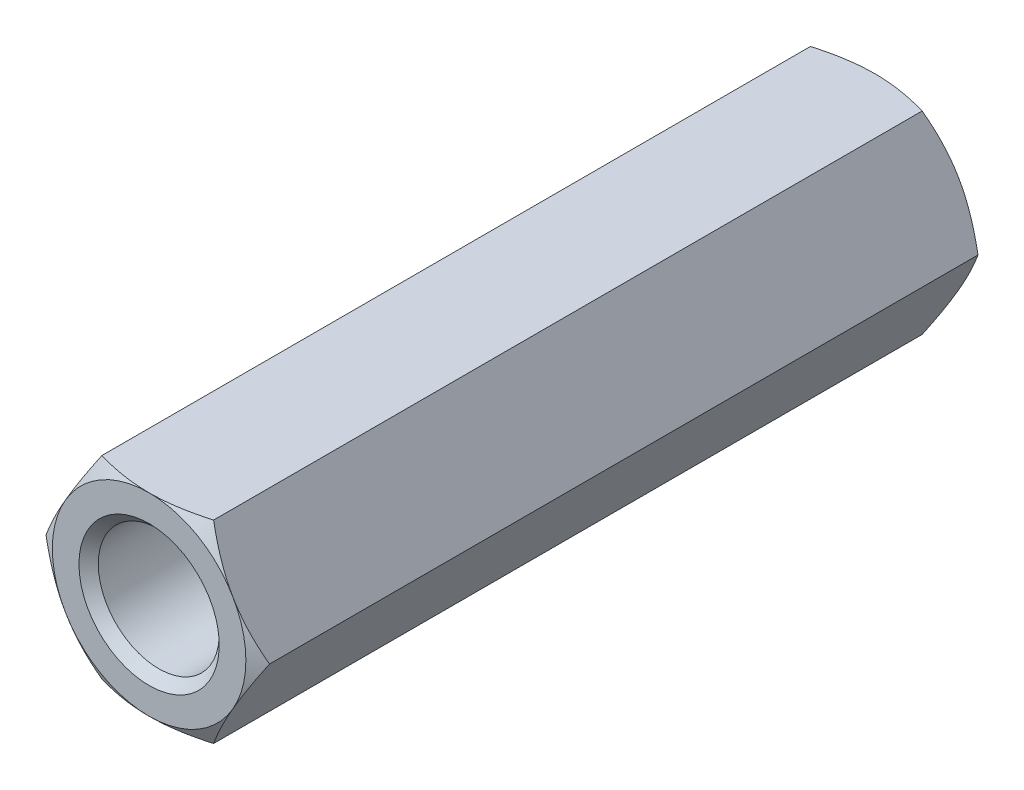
from build123d import *

# Parameters (mm, degrees)
BOSS_EXTRUDE1_DEPTH      = 15
SKETCH2_OUTSIDE_W        = 74.678
SKETCH2_OUTSIDE_H        = 73.44
SKETCH2_OUTSIDE_R        = 4
CUT_EXTRUDE1_DEPTH       = 17.196707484
CUT_EXTRUDE1_DRAFT       = -60
SKETCH3_R                = 2.5
SKETCH3_R_2              = 2.1
CUT_EXTRUDE2_DEPTH       = 10
SKETCH3_2_R              = 2.1
CUT_EXTRUDE3_DEPTH       = 11.2
CHAMFER1_SIZE            = 0.4
MIRROR1_COPY_1_SKETCH_W  = 74.678
MIRROR1_COPY_1_SKETCH_H  = 73.44
MIRROR1_COPY_1_SKETCH_R  = 4
MIRROR1_COPY_1_DEPTH     = 17.196707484
MIRROR1_COPY_1_DRAFT     = -60
CHAMFER1_OF_MIRROR1_SIZE = 0.4


with BuildPart() as part:
    # Sketch1 → Boss-Extrude1 (new body)
    with BuildSketch(Plane.XY):
        Polygon((2.309401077, 4), (-2.309401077, 4), (-4.618802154, 0), (-2.309401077, -4), (2.309401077, -4), (4.618802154, 0), align=None)
    boss_extrude1 = extrude(amount=-BOSS_EXTRUDE1_DEPTH)


with BuildPart() as cut_extrude1_tool:
    # Sketch2 outside → Cut-Extrude1 (with draft: the straight prism first)
    with BuildSketch(Plane(origin=(0, 0, -15), x_dir=(-1, 0, 0), z_dir=(0, 0, -1))):
        Rectangle(SKETCH2_OUTSIDE_W, SKETCH2_OUTSIDE_H)
        Circle(SKETCH2_OUTSIDE_R, mode=Mode.SUBTRACT)
    extrude(amount=-CUT_EXTRUDE1_DEPTH)
    # Cut-Extrude1: the draft: its side faces are tilted about the plane it starts from
    cut_extrude1_sides = [cut_extrude1_tool.faces().sort_by_distance(p)[0] for p in [
        (0, -36.72, -6.401646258),
        (-37.339, 0, -6.401646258),
        (0, 36.72, -6.401646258),
        (37.339, 0, -6.401646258),
        (4, 0, -6.401646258),
    ]]
    draft(cut_extrude1_sides, Plane(origin=(0, 0, -15), x_dir=(-1, 0, 0), z_dir=(0, 0, -1)), CUT_EXTRUDE1_DRAFT)


with BuildPart() as part_1:
    add(part.part)

    # Cut-Extrude1: cut by cut_extrude1_tool
    add(cut_extrude1_tool.part, mode=Mode.SUBTRACT)

    # Sketch3 → Cut-Extrude2 (cut)
    with BuildSketch(Plane(origin=(0, 0, -15), x_dir=(-1, 0, 0), z_dir=(0, 0, -1))):
        Circle(SKETCH3_R)
        Circle(SKETCH3_R_2, mode=Mode.SUBTRACT)
    cut_extrude2 = extrude(amount=-CUT_EXTRUDE2_DEPTH, mode=Mode.SUBTRACT)

    # Sketch3_2 → Cut-Extrude3 (cut)
    with BuildSketch(Plane(origin=(0, 0, -15), x_dir=(-1, 0, 0), z_dir=(0, 0, -1))):
        Circle(SKETCH3_2_R)
    cut_extrude3 = extrude(amount=-CUT_EXTRUDE3_DEPTH, mode=Mode.SUBTRACT)

    # Cut-Extrude4 cone 1 section (on through the dimple's axis) → Cut-Extrude4 (revolve, cut)
    with BuildSketch(Plane(origin=(0, 0, -3.8), x_dir=(0, 1, 0), z_dir=(1, 0, 0))):
        Polygon((0, 0), (2.1, 0), (0, 1.212435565), align=None)
    revolve(axis=Axis((0, 0, -3.8), (0, 0, 1)), mode=Mode.SUBTRACT)

    # Chamfer1
    chamfer1_edges = [part_1.edges().sort_by_distance(p)[0] for p in [
        (2.5, 0, -15),
    ]]
    chamfer(chamfer1_edges, length=CHAMFER1_SIZE)

    # Mirror1: Boss-Extrude1, Cut-Extrude2, Cut-Extrude3 across plane
    add(boss_extrude1.mirror(Plane.XY))
    add(cut_extrude2.mirror(Plane.XY), mode=Mode.SUBTRACT)
    add(cut_extrude3.mirror(Plane.XY), mode=Mode.SUBTRACT)


with BuildPart() as mirror1_copy_1_tool:
    # Mirror1 copy 1 sketch → Mirror1 copy 1 (with draft: the straight prism first)
    with BuildSketch(Plane(origin=(0, 0, 15), x_dir=(-1, 0, 0), z_dir=(0, 0, 1))):
        Rectangle(MIRROR1_COPY_1_SKETCH_W, MIRROR1_COPY_1_SKETCH_H)
        Circle(MIRROR1_COPY_1_SKETCH_R, mode=Mode.SUBTRACT)
    extrude(amount=-MIRROR1_COPY_1_DEPTH)
    # Mirror1 copy 1: the draft: its side faces are tilted about the plane it starts from
    mirror1_copy_1_sides = [mirror1_copy_1_tool.faces().sort_by_distance(p)[0] for p in [
        (0, -36.72, 6.401646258),
        (-37.339, 0, 6.401646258),
        (0, 36.72, 6.401646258),
        (37.339, 0, 6.401646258),
        (4, 0, 6.401646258),
    ]]
    draft(mirror1_copy_1_sides, Plane(origin=(0, 0, 15), x_dir=(-1, 0, 0), z_dir=(0, 0, 1)), MIRROR1_COPY_1_DRAFT)


with BuildPart() as part_2:
    add(part_1.part)

    # Mirror1 copy 1: cut by mirror1_copy_1_tool
    add(mirror1_copy_1_tool.part, mode=Mode.SUBTRACT)

    # Chamfer1 of Mirror1
    chamfer1_of_mirror1_edges = [part_2.edges().sort_by_distance(p)[0] for p in [
        (2.5, 0, 15),
    ]]
    chamfer(chamfer1_of_mirror1_edges, length=CHAMFER1_OF_MIRROR1_SIZE)


solid = part_2.part
